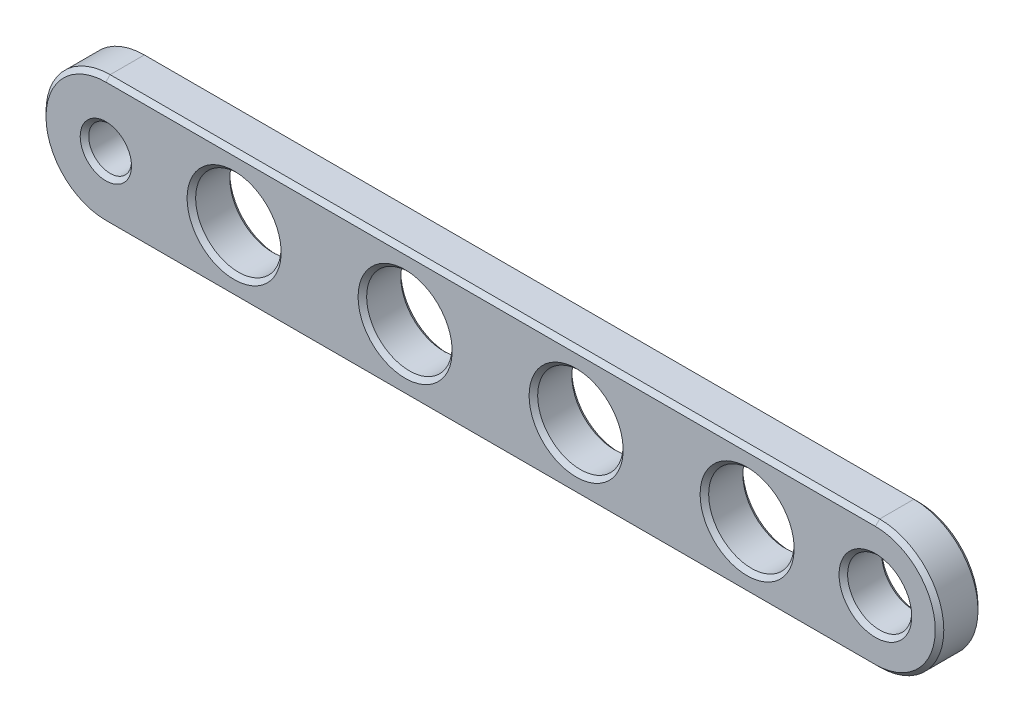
from build123d import *

# Parameters (mm, degrees)
SKETCH1_R           = 1
SKETCH1_R_2         = 1.5
SKETCH1_R_3         = 2
BOSS_EXTRUDE1_DEPTH = 2
CHAMFER1_SIZE       = 0.2


with BuildPart() as part:
    # Sketch1 → Boss-Extrude1 (new body)
    with BuildSketch(Plane.XY):
        with BuildLine():
            Line((-17.346835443, 3), (18.653164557, 3))
            ThreePointArc((18.653164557, 3), (21.653164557, 0), (18.653164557, -3))
            Line((18.653164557, -3), (-17.346835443, -3))
            ThreePointArc((-17.346835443, -3), (-20.346835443, 0), (-17.346835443, 3))
        make_face()
        with Locations((-17.346835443, 0)):
            Circle(SKETCH1_R, mode=Mode.SUBTRACT)
        with Locations((18.653164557, 0)):
            Circle(SKETCH1_R_2, mode=Mode.SUBTRACT)
        with Locations((-11.346835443, 0)):
            Circle(SKETCH1_R_3, mode=Mode.SUBTRACT)
        with Locations((-3.346835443, 0)):
            Circle(SKETCH1_R_3, mode=Mode.SUBTRACT)
        with Locations((4.653164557, 0)):
            Circle(SKETCH1_R_3, mode=Mode.SUBTRACT)
        with Locations((12.653164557, 0)):
            Circle(SKETCH1_R_3, mode=Mode.SUBTRACT)
    extrude(amount=BOSS_EXTRUDE1_DEPTH)

    # Chamfer1
    chamfer1_edges = [part.edges().sort_by_distance(p)[0] for p in [
        (-18.346835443, 0, 0),
        (-18.346835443, 0, 2),
        (-20.346835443, 0, 2),
        (17.153164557, 0, 0),
        (17.153164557, 0, 2),
        (0.653164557, -3, 2),
        (-13.346835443, 0, 0),
        (-13.346835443, 0, 2),
        (-5.346835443, 0, 0),
        (-5.346835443, 0, 2),
        (2.653164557, 0, 0),
        (2.653164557, 0, 2),
        (10.653164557, 0, 0),
        (10.653164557, 0, 2),
        (21.653164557, 0, 2),
        (0.653164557, -3, 0),
        (-20.346835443, 0, 0),
        (0.653164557, 3, 0),
        (21.653164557, 0, 0),
        (0.653164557, 3, 2),
    ]]
    chamfer(chamfer1_edges, length=CHAMFER1_SIZE)


solid = part.part
